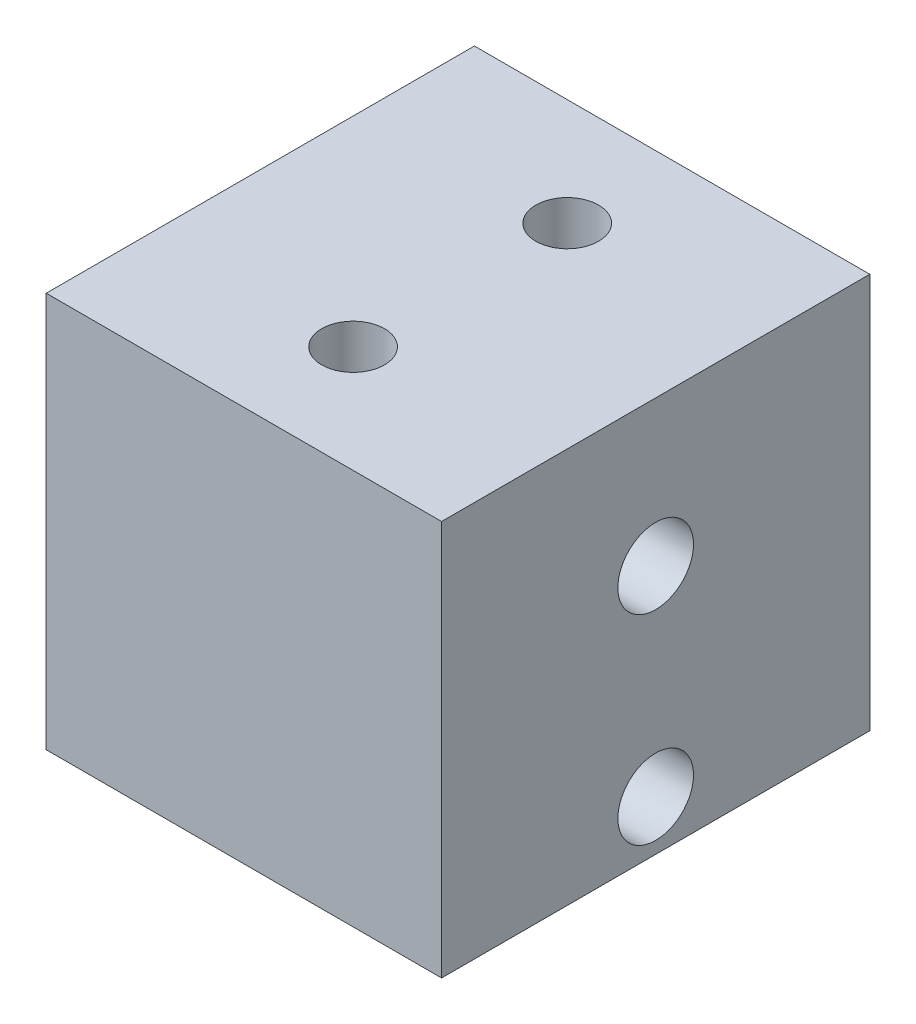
ISO-10303-21;
HEADER;
FILE_DESCRIPTION(('STEP AP214'),'2;1');
FILE_NAME('part.step','',(''),(''),'','','');
FILE_SCHEMA(('AUTOMOTIVE_DESIGN { 1 0 10303 214 1 1 1 1 }'));
ENDSEC;
DATA;
#1=APPLICATION_CONTEXT('core data for automotive mechanical design processes');
#2=APPLICATION_PROTOCOL_DEFINITION('international standard','automotive_design',2000,#1);
#3=PRODUCT_CONTEXT('',#1,'mechanical');
#4=PRODUCT('Part','Part','',(#3));
#5=PRODUCT_RELATED_PRODUCT_CATEGORY('part','',(#4));
#6=PRODUCT_DEFINITION_FORMATION('','',#4);
#7=PRODUCT_DEFINITION_CONTEXT('part definition',#1,'design');
#8=PRODUCT_DEFINITION('design','',#6,#7);
#9=PRODUCT_DEFINITION_SHAPE('','',#8);
#10=(LENGTH_UNIT() NAMED_UNIT(*) SI_UNIT(.MILLI.,.METRE.));
#11=(NAMED_UNIT(*) PLANE_ANGLE_UNIT() SI_UNIT($,.RADIAN.));
#12=(NAMED_UNIT(*) SI_UNIT($,.STERADIAN.) SOLID_ANGLE_UNIT());
#13=UNCERTAINTY_MEASURE_WITH_UNIT(LENGTH_MEASURE(1.E-05),#10,'distance_accuracy_value','');
#14=(GEOMETRIC_REPRESENTATION_CONTEXT(3) GLOBAL_UNCERTAINTY_ASSIGNED_CONTEXT((#13)) GLOBAL_UNIT_ASSIGNED_CONTEXT((#10,
#11,#12)) REPRESENTATION_CONTEXT('',''));
#15=CARTESIAN_POINT('',(0.,0.,0.));
#16=DIRECTION('',(0.,0.,1.));
#17=DIRECTION('',(1.,0.,0.));
#18=AXIS2_PLACEMENT_3D('',#15,#16,#17);
#19=CARTESIAN_POINT('',(0.,0.,0.));
#20=DIRECTION('',(0.,0.,-1.));
#21=DIRECTION('',(0.,-1.,0.));
#22=AXIS2_PLACEMENT_3D('',#19,#20,#21);
#23=PLANE('',#22);
#24=DIRECTION('',(0.,1.,0.));
#25=VECTOR('',#24,1.);
#26=CARTESIAN_POINT('',(13.85,-13.85,0.));
#27=LINE('',#26,#25);
#28=CARTESIAN_POINT('',(13.85,-13.85,0.));
#29=VERTEX_POINT('',#28);
#30=CARTESIAN_POINT('',(13.85,13.85,0.));
#31=VERTEX_POINT('',#30);
#32=EDGE_CURVE('E95',#29,#31,#27,.T.);
#33=ORIENTED_EDGE('',*,*,#32,.F.);
#34=DIRECTION('',(1.,0.,0.));
#35=VECTOR('',#34,1.);
#36=CARTESIAN_POINT('',(-13.85,-13.85,0.));
#37=LINE('',#36,#35);
#38=CARTESIAN_POINT('',(-13.85,-13.85,0.));
#39=VERTEX_POINT('',#38);
#40=EDGE_CURVE('E26',#39,#29,#37,.T.);
#41=ORIENTED_EDGE('',*,*,#40,.F.);
#42=DIRECTION('',(0.,-1.,0.));
#43=VECTOR('',#42,1.);
#44=CARTESIAN_POINT('',(-13.85,-13.85,0.));
#45=LINE('',#44,#43);
#46=CARTESIAN_POINT('',(-13.85,13.85,0.));
#47=VERTEX_POINT('',#46);
#48=EDGE_CURVE('E85',#47,#39,#45,.T.);
#49=ORIENTED_EDGE('',*,*,#48,.F.);
#50=DIRECTION('',(-1.,0.,0.));
#51=VECTOR('',#50,1.);
#52=CARTESIAN_POINT('',(-13.85,13.85,0.));
#53=LINE('',#52,#51);
#54=EDGE_CURVE('E108',#31,#47,#53,.T.);
#55=ORIENTED_EDGE('',*,*,#54,.F.);
#56=EDGE_LOOP('',(#33,#41,#49,#55));
#57=FACE_BOUND('',#56,.T.);
#58=ADVANCED_FACE('F17',(#57),#23,.T.);
#59=CARTESIAN_POINT('',(0.,0.,30.));
#60=DIRECTION('',(0.,0.,-1.));
#61=DIRECTION('',(0.,-1.,0.));
#62=AXIS2_PLACEMENT_3D('',#59,#60,#61);
#63=PLANE('',#62);
#64=DIRECTION('',(0.,1.,0.));
#65=VECTOR('',#64,1.);
#66=CARTESIAN_POINT('',(13.85,-13.85,30.));
#67=LINE('',#66,#65);
#68=CARTESIAN_POINT('',(13.85,-13.85,30.));
#69=VERTEX_POINT('',#68);
#70=CARTESIAN_POINT('',(13.85,13.85,30.));
#71=VERTEX_POINT('',#70);
#72=EDGE_CURVE('E88',#69,#71,#67,.T.);
#73=ORIENTED_EDGE('',*,*,#72,.T.);
#74=DIRECTION('',(-1.,0.,0.));
#75=VECTOR('',#74,1.);
#76=CARTESIAN_POINT('',(-13.85,13.85,30.));
#77=LINE('',#76,#75);
#78=CARTESIAN_POINT('',(-13.85,13.85,30.));
#79=VERTEX_POINT('',#78);
#80=EDGE_CURVE('E74',#71,#79,#77,.T.);
#81=ORIENTED_EDGE('',*,*,#80,.T.);
#82=DIRECTION('',(0.,-1.,0.));
#83=VECTOR('',#82,1.);
#84=CARTESIAN_POINT('',(-13.85,-13.85,30.));
#85=LINE('',#84,#83);
#86=CARTESIAN_POINT('',(-13.85,-13.85,30.));
#87=VERTEX_POINT('',#86);
#88=EDGE_CURVE('E117',#79,#87,#85,.T.);
#89=ORIENTED_EDGE('',*,*,#88,.T.);
#90=DIRECTION('',(1.,0.,0.));
#91=VECTOR('',#90,1.);
#92=CARTESIAN_POINT('',(-13.85,-13.85,30.));
#93=LINE('',#92,#91);
#94=EDGE_CURVE('E11',#87,#69,#93,.T.);
#95=ORIENTED_EDGE('',*,*,#94,.T.);
#96=EDGE_LOOP('',(#73,#81,#89,#95));
#97=FACE_BOUND('',#96,.T.);
#98=ADVANCED_FACE('F19',(#97),#63,.F.);
#99=CARTESIAN_POINT('',(-13.85,-13.85,30.));
#100=DIRECTION('',(0.,1.,0.));
#101=DIRECTION('',(1.,0.,0.));
#102=AXIS2_PLACEMENT_3D('',#99,#100,#101);
#103=PLANE('',#102);
#104=CARTESIAN_POINT('',(0.150000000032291,-13.85,22.5000000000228));
#105=DIRECTION('',(0.,1.,0.));
#106=DIRECTION('',(0.,0.,1.));
#107=AXIS2_PLACEMENT_3D('',#104,#105,#106);
#108=CIRCLE('',#107,2.19999999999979);
#109=CARTESIAN_POINT('',(0.150000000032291,-13.85,24.7000000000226));
#110=VERTEX_POINT('',#109);
#111=EDGE_CURVE('E146',#110,#110,#108,.T.);
#112=ORIENTED_EDGE('',*,*,#111,.T.);
#113=EDGE_LOOP('',(#112));
#114=FACE_BOUND('',#113,.T.);
#115=CARTESIAN_POINT('',(0.150000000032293,-13.85,7.50000000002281));
#116=DIRECTION('',(0.,1.,0.));
#117=DIRECTION('',(0.,0.,1.));
#118=AXIS2_PLACEMENT_3D('',#115,#116,#117);
#119=CIRCLE('',#118,2.19999999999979);
#120=CARTESIAN_POINT('',(0.150000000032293,-13.85,9.70000000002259));
#121=VERTEX_POINT('',#120);
#122=EDGE_CURVE('E157',#121,#121,#119,.T.);
#123=ORIENTED_EDGE('',*,*,#122,.T.);
#124=EDGE_LOOP('',(#123));
#125=FACE_BOUND('',#124,.T.);
#126=ORIENTED_EDGE('',*,*,#40,.T.);
#127=DIRECTION('',(0.,0.,-1.));
#128=VECTOR('',#127,1.);
#129=CARTESIAN_POINT('',(13.85,-13.85,30.));
#130=LINE('',#129,#128);
#131=EDGE_CURVE('E92',#69,#29,#130,.T.);
#132=ORIENTED_EDGE('',*,*,#131,.F.);
#133=ORIENTED_EDGE('',*,*,#94,.F.);
#134=DIRECTION('',(0.,0.,-1.));
#135=VECTOR('',#134,1.);
#136=CARTESIAN_POINT('',(-13.85,-13.85,30.));
#137=LINE('',#136,#135);
#138=EDGE_CURVE('E114',#87,#39,#137,.T.);
#139=ORIENTED_EDGE('',*,*,#138,.T.);
#140=EDGE_LOOP('',(#126,#132,#133,#139));
#141=FACE_BOUND('',#140,.T.);
#142=ADVANCED_FACE('F122',(#114,#125,#141),#103,.F.);
#143=CARTESIAN_POINT('',(-13.85,-13.85,30.));
#144=DIRECTION('',(1.,0.,0.));
#145=DIRECTION('',(0.,1.,0.));
#146=AXIS2_PLACEMENT_3D('',#143,#144,#145);
#147=PLANE('',#146);
#148=CARTESIAN_POINT('',(-13.85,3.65,15.));
#149=DIRECTION('',(1.,0.,0.));
#150=DIRECTION('',(0.,0.,-1.));
#151=AXIS2_PLACEMENT_3D('',#148,#149,#150);
#152=CIRCLE('',#151,2.65);
#153=CARTESIAN_POINT('',(-13.85,3.65,12.35));
#154=VERTEX_POINT('',#153);
#155=EDGE_CURVE('E133',#154,#154,#152,.T.);
#156=ORIENTED_EDGE('',*,*,#155,.T.);
#157=EDGE_LOOP('',(#156));
#158=FACE_BOUND('',#157,.T.);
#159=CARTESIAN_POINT('',(-13.85,-10.35,15.));
#160=DIRECTION('',(1.,0.,0.));
#161=DIRECTION('',(0.,0.,-1.));
#162=AXIS2_PLACEMENT_3D('',#159,#160,#161);
#163=CIRCLE('',#162,2.65);
#164=CARTESIAN_POINT('',(-13.85,-10.35,12.35));
#165=VERTEX_POINT('',#164);
#166=EDGE_CURVE('E141',#165,#165,#163,.T.);
#167=ORIENTED_EDGE('',*,*,#166,.T.);
#168=EDGE_LOOP('',(#167));
#169=FACE_BOUND('',#168,.T.);
#170=ORIENTED_EDGE('',*,*,#48,.T.);
#171=ORIENTED_EDGE('',*,*,#138,.F.);
#172=ORIENTED_EDGE('',*,*,#88,.F.);
#173=DIRECTION('',(0.,0.,-1.));
#174=VECTOR('',#173,1.);
#175=CARTESIAN_POINT('',(-13.85,13.85,30.));
#176=LINE('',#175,#174);
#177=EDGE_CURVE('E82',#79,#47,#176,.T.);
#178=ORIENTED_EDGE('',*,*,#177,.T.);
#179=EDGE_LOOP('',(#170,#171,#172,#178));
#180=FACE_BOUND('',#179,.T.);
#181=ADVANCED_FACE('F125',(#158,#169,#180),#147,.F.);
#182=CARTESIAN_POINT('',(-13.85,13.85,30.));
#183=DIRECTION('',(0.,-1.,0.));
#184=DIRECTION('',(0.,0.,-1.));
#185=AXIS2_PLACEMENT_3D('',#182,#183,#184);
#186=PLANE('',#185);
#187=CARTESIAN_POINT('',(0.150000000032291,13.85,22.5000000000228));
#188=DIRECTION('',(0.,1.,0.));
#189=DIRECTION('',(0.,0.,1.));
#190=AXIS2_PLACEMENT_3D('',#187,#188,#189);
#191=CIRCLE('',#190,2.19999999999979);
#192=CARTESIAN_POINT('',(0.150000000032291,13.85,24.7000000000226));
#193=VERTEX_POINT('',#192);
#194=EDGE_CURVE('E142',#193,#193,#191,.T.);
#195=ORIENTED_EDGE('',*,*,#194,.F.);
#196=EDGE_LOOP('',(#195));
#197=FACE_BOUND('',#196,.T.);
#198=CARTESIAN_POINT('',(0.150000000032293,13.85,7.50000000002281));
#199=DIRECTION('',(0.,1.,0.));
#200=DIRECTION('',(0.,0.,1.));
#201=AXIS2_PLACEMENT_3D('',#198,#199,#200);
#202=CIRCLE('',#201,2.19999999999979);
#203=CARTESIAN_POINT('',(0.150000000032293,13.85,9.70000000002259));
#204=VERTEX_POINT('',#203);
#205=EDGE_CURVE('E153',#204,#204,#202,.T.);
#206=ORIENTED_EDGE('',*,*,#205,.F.);
#207=EDGE_LOOP('',(#206));
#208=FACE_BOUND('',#207,.T.);
#209=ORIENTED_EDGE('',*,*,#54,.T.);
#210=ORIENTED_EDGE('',*,*,#177,.F.);
#211=ORIENTED_EDGE('',*,*,#80,.F.);
#212=DIRECTION('',(0.,0.,-1.));
#213=VECTOR('',#212,1.);
#214=CARTESIAN_POINT('',(13.85,13.85,30.));
#215=LINE('',#214,#213);
#216=EDGE_CURVE('E79',#71,#31,#215,.T.);
#217=ORIENTED_EDGE('',*,*,#216,.T.);
#218=EDGE_LOOP('',(#209,#210,#211,#217));
#219=FACE_BOUND('',#218,.T.);
#220=ADVANCED_FACE('F77',(#197,#208,#219),#186,.F.);
#221=CARTESIAN_POINT('',(13.85,-13.85,30.));
#222=DIRECTION('',(-1.,0.,0.));
#223=DIRECTION('',(0.,0.,1.));
#224=AXIS2_PLACEMENT_3D('',#221,#222,#223);
#225=PLANE('',#224);
#226=CARTESIAN_POINT('',(13.85,3.65,15.));
#227=DIRECTION('',(1.,0.,0.));
#228=DIRECTION('',(0.,0.,-1.));
#229=AXIS2_PLACEMENT_3D('',#226,#227,#228);
#230=CIRCLE('',#229,2.65);
#231=CARTESIAN_POINT('',(13.85,3.65,12.35));
#232=VERTEX_POINT('',#231);
#233=EDGE_CURVE('E102',#232,#232,#230,.T.);
#234=ORIENTED_EDGE('',*,*,#233,.F.);
#235=EDGE_LOOP('',(#234));
#236=FACE_BOUND('',#235,.T.);
#237=CARTESIAN_POINT('',(13.85,-10.35,15.));
#238=DIRECTION('',(1.,0.,0.));
#239=DIRECTION('',(0.,0.,-1.));
#240=AXIS2_PLACEMENT_3D('',#237,#238,#239);
#241=CIRCLE('',#240,2.65);
#242=CARTESIAN_POINT('',(13.85,-10.35,12.35));
#243=VERTEX_POINT('',#242);
#244=EDGE_CURVE('E137',#243,#243,#241,.T.);
#245=ORIENTED_EDGE('',*,*,#244,.F.);
#246=EDGE_LOOP('',(#245));
#247=FACE_BOUND('',#246,.T.);
#248=ORIENTED_EDGE('',*,*,#32,.T.);
#249=ORIENTED_EDGE('',*,*,#216,.F.);
#250=ORIENTED_EDGE('',*,*,#72,.F.);
#251=ORIENTED_EDGE('',*,*,#131,.T.);
#252=EDGE_LOOP('',(#248,#249,#250,#251));
#253=FACE_BOUND('',#252,.T.);
#254=ADVANCED_FACE('F94',(#236,#247,#253),#225,.F.);
#255=CARTESIAN_POINT('',(-13.85,3.65,15.));
#256=DIRECTION('',(1.,0.,0.));
#257=DIRECTION('',(0.,0.,-1.));
#258=AXIS2_PLACEMENT_3D('',#255,#256,#257);
#259=CYLINDRICAL_SURFACE('',#258,2.65);
#260=ORIENTED_EDGE('',*,*,#233,.T.);
#261=EDGE_LOOP('',(#260));
#262=FACE_BOUND('',#261,.T.);
#263=ORIENTED_EDGE('',*,*,#155,.F.);
#264=EDGE_LOOP('',(#263));
#265=FACE_BOUND('',#264,.T.);
#266=ADVANCED_FACE('F185',(#262,#265),#259,.F.);
#267=CARTESIAN_POINT('',(-13.85,-10.35,15.));
#268=DIRECTION('',(1.,0.,0.));
#269=DIRECTION('',(0.,0.,-1.));
#270=AXIS2_PLACEMENT_3D('',#267,#268,#269);
#271=CYLINDRICAL_SURFACE('',#270,2.65);
#272=ORIENTED_EDGE('',*,*,#244,.T.);
#273=EDGE_LOOP('',(#272));
#274=FACE_BOUND('',#273,.T.);
#275=ORIENTED_EDGE('',*,*,#166,.F.);
#276=EDGE_LOOP('',(#275));
#277=FACE_BOUND('',#276,.T.);
#278=ADVANCED_FACE('F174',(#274,#277),#271,.F.);
#279=CARTESIAN_POINT('',(0.150000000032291,-13.85,22.5000000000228));
#280=DIRECTION('',(0.,1.,0.));
#281=DIRECTION('',(0.,0.,1.));
#282=AXIS2_PLACEMENT_3D('',#279,#280,#281);
#283=CYLINDRICAL_SURFACE('',#282,2.19999999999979);
#284=ORIENTED_EDGE('',*,*,#194,.T.);
#285=EDGE_LOOP('',(#284));
#286=FACE_BOUND('',#285,.T.);
#287=ORIENTED_EDGE('',*,*,#111,.F.);
#288=EDGE_LOOP('',(#287));
#289=FACE_BOUND('',#288,.T.);
#290=ADVANCED_FACE('F167',(#286,#289),#283,.F.);
#291=CARTESIAN_POINT('',(0.150000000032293,-13.85,7.50000000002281));
#292=DIRECTION('',(0.,1.,0.));
#293=DIRECTION('',(0.,0.,1.));
#294=AXIS2_PLACEMENT_3D('',#291,#292,#293);
#295=CYLINDRICAL_SURFACE('',#294,2.19999999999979);
#296=ORIENTED_EDGE('',*,*,#205,.T.);
#297=EDGE_LOOP('',(#296));
#298=FACE_BOUND('',#297,.T.);
#299=ORIENTED_EDGE('',*,*,#122,.F.);
#300=EDGE_LOOP('',(#299));
#301=FACE_BOUND('',#300,.T.);
#302=ADVANCED_FACE('F165',(#298,#301),#295,.F.);
#303=CLOSED_SHELL('',(#58,#98,#142,#181,#220,#254,#266,#278,#290,#302));
#304=MANIFOLD_SOLID_BREP('B1',#303);
#305=ADVANCED_BREP_SHAPE_REPRESENTATION('',(#18,#304),#14);
#306=SHAPE_DEFINITION_REPRESENTATION(#9,#305);
ENDSEC;
END-ISO-10303-21;
